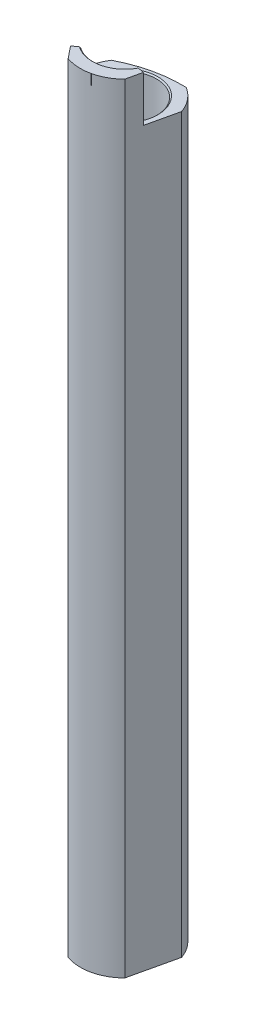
ISO-10303-21;
HEADER;
FILE_DESCRIPTION(('STEP AP214'),'2;1');
FILE_NAME('part.step','',(''),(''),'','','');
FILE_SCHEMA(('AUTOMOTIVE_DESIGN { 1 0 10303 214 1 1 1 1 }'));
ENDSEC;
DATA;
#1=APPLICATION_CONTEXT('core data for automotive mechanical design processes');
#2=APPLICATION_PROTOCOL_DEFINITION('international standard','automotive_design',2000,#1);
#3=PRODUCT_CONTEXT('',#1,'mechanical');
#4=PRODUCT('Part','Part','',(#3));
#5=PRODUCT_RELATED_PRODUCT_CATEGORY('part','',(#4));
#6=PRODUCT_DEFINITION_FORMATION('','',#4);
#7=PRODUCT_DEFINITION_CONTEXT('part definition',#1,'design');
#8=PRODUCT_DEFINITION('design','',#6,#7);
#9=PRODUCT_DEFINITION_SHAPE('','',#8);
#10=(LENGTH_UNIT() NAMED_UNIT(*) SI_UNIT(.MILLI.,.METRE.));
#11=(NAMED_UNIT(*) PLANE_ANGLE_UNIT() SI_UNIT($,.RADIAN.));
#12=(NAMED_UNIT(*) SI_UNIT($,.STERADIAN.) SOLID_ANGLE_UNIT());
#13=UNCERTAINTY_MEASURE_WITH_UNIT(LENGTH_MEASURE(1.E-05),#10,'distance_accuracy_value','');
#14=(GEOMETRIC_REPRESENTATION_CONTEXT(3) GLOBAL_UNCERTAINTY_ASSIGNED_CONTEXT((#13)) GLOBAL_UNIT_ASSIGNED_CONTEXT((#10,
#11,#12)) REPRESENTATION_CONTEXT('',''));
#15=CARTESIAN_POINT('',(0.,0.,0.));
#16=DIRECTION('',(0.,0.,1.));
#17=DIRECTION('',(1.,0.,0.));
#18=AXIS2_PLACEMENT_3D('',#15,#16,#17);
#19=CARTESIAN_POINT('',(0.,-364.49,0.));
#20=DIRECTION('',(0.,1.,0.));
#21=DIRECTION('',(0.,0.,1.));
#22=AXIS2_PLACEMENT_3D('',#19,#20,#21);
#23=CYLINDRICAL_SURFACE('',#22,60.96);
#24=DIRECTION('',(0.,1.,0.));
#25=VECTOR('',#24,1.);
#26=CARTESIAN_POINT('',(-28.2876545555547,-9.4805375,-53.9993536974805));
#27=LINE('',#26,#25);
#28=CARTESIAN_POINT('',(-28.2876545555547,-28.3718,-53.9993536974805));
#29=VERTEX_POINT('',#28);
#30=CARTESIAN_POINT('',(-28.2876545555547,-0.508000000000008,-53.9993536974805));
#31=VERTEX_POINT('',#30);
#32=EDGE_CURVE('E371',#29,#31,#27,.T.);
#33=ORIENTED_EDGE('',*,*,#32,.T.);
#34=CARTESIAN_POINT('',(0.,-0.508000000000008,0.));
#35=DIRECTION('',(0.,1.,0.));
#36=DIRECTION('',(0.,0.,1.));
#37=AXIS2_PLACEMENT_3D('',#34,#35,#36);
#38=CIRCLE('',#37,60.96);
#39=CARTESIAN_POINT('',(2.05685460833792,-0.508000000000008,-60.9252898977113));
#40=VERTEX_POINT('',#39);
#41=EDGE_CURVE('E321',#31,#40,#38,.F.);
#42=ORIENTED_EDGE('',*,*,#41,.T.);
#43=DIRECTION('',(0.,1.,0.));
#44=VECTOR('',#43,1.);
#45=CARTESIAN_POINT('',(2.05685460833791,-9.4805375,-60.9252898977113));
#46=LINE('',#45,#44);
#47=CARTESIAN_POINT('',(2.05685460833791,-28.3718,-60.9252898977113));
#48=VERTEX_POINT('',#47);
#49=EDGE_CURVE('E378',#40,#48,#46,.F.);
#50=ORIENTED_EDGE('',*,*,#49,.T.);
#51=CARTESIAN_POINT('',(0.,-28.3718,0.));
#52=DIRECTION('',(0.,-1.,0.));
#53=DIRECTION('',(0.,0.,-1.));
#54=AXIS2_PLACEMENT_3D('',#51,#52,#53);
#55=CIRCLE('',#54,60.96);
#56=EDGE_CURVE('E455',#48,#29,#55,.F.);
#57=ORIENTED_EDGE('',*,*,#56,.T.);
#58=EDGE_LOOP('',(#33,#42,#50,#57));
#59=FACE_BOUND('',#58,.T.);
#60=ADVANCED_FACE('F108',(#59),#23,.T.);
#61=CARTESIAN_POINT('',(-9.60845392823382,-256.300662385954,-42.0973872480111));
#62=DIRECTION('',(0.,1.,0.));
#63=DIRECTION('',(0.,0.,1.));
#64=AXIS2_PLACEMENT_3D('',#61,#62,#63);
#65=CYLINDRICAL_SURFACE('',#64,22.1488);
#66=CARTESIAN_POINT('',(-9.60845392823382,-29.0068,-42.0973872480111));
#67=DIRECTION('',(0.,-1.,0.));
#68=DIRECTION('',(0.,0.,-1.));
#69=AXIS2_PLACEMENT_3D('',#66,#67,#68);
#70=CIRCLE('',#69,22.1488);
#71=CARTESIAN_POINT('',(-27.5436367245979,-29.0068,-55.0934851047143));
#72=VERTEX_POINT('',#71);
#73=CARTESIAN_POINT('',(-26.0935079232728,-29.0068,-56.8896939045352));
#74=VERTEX_POINT('',#73);
#75=EDGE_CURVE('E374',#72,#74,#70,.T.);
#76=ORIENTED_EDGE('',*,*,#75,.T.);
#77=DIRECTION('',(0.,1.,0.));
#78=VECTOR('',#77,1.);
#79=CARTESIAN_POINT('',(-26.0935079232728,-256.300662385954,-56.8896939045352));
#80=LINE('',#79,#78);
#81=CARTESIAN_POINT('',(-26.0935079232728,-41.2623,-56.8896939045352));
#82=VERTEX_POINT('',#81);
#83=EDGE_CURVE('E593',#74,#82,#80,.F.);
#84=ORIENTED_EDGE('',*,*,#83,.T.);
#85=CARTESIAN_POINT('',(-9.60845392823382,-41.2623,-42.0973872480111));
#86=DIRECTION('',(0.,1.,0.));
#87=DIRECTION('',(0.,0.,1.));
#88=AXIS2_PLACEMENT_3D('',#85,#86,#87);
#89=CIRCLE('',#88,22.1488);
#90=CARTESIAN_POINT('',(-1.17407481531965,-41.2623,-62.5773918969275));
#91=VERTEX_POINT('',#90);
#92=EDGE_CURVE('E122',#91,#82,#89,.T.);
#93=ORIENTED_EDGE('',*,*,#92,.F.);
#94=DIRECTION('',(0.,1.,0.));
#95=VECTOR('',#94,1.);
#96=CARTESIAN_POINT('',(-1.17407481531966,-256.300662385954,-62.5773918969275));
#97=LINE('',#96,#95);
#98=CARTESIAN_POINT('',(-1.17407481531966,-29.0068,-62.5773918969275));
#99=VERTEX_POINT('',#98);
#100=EDGE_CURVE('E591',#91,#99,#97,.T.);
#101=ORIENTED_EDGE('',*,*,#100,.T.);
#102=CARTESIAN_POINT('',(-9.60845392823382,-29.0068,-42.0973872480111));
#103=DIRECTION('',(0.,-1.,0.));
#104=DIRECTION('',(0.,0.,-1.));
#105=AXIS2_PLACEMENT_3D('',#102,#103,#104);
#106=CIRCLE('',#105,22.1488);
#107=CARTESIAN_POINT('',(0.911791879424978,-29.0068,-61.5882509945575));
#108=VERTEX_POINT('',#107);
#109=EDGE_CURVE('E380',#99,#108,#106,.T.);
#110=ORIENTED_EDGE('',*,*,#109,.T.);
#111=CARTESIAN_POINT('',(0.911791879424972,-29.0068,-61.5882509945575));
#112=CARTESIAN_POINT('',(0.943001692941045,-29.0067975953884,-61.5714054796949));
#113=CARTESIAN_POINT('',(0.974168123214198,-29.006166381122,-61.554486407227));
#114=CARTESIAN_POINT('',(1.03638543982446,-29.0036022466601,-61.5205176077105));
#115=CARTESIAN_POINT('',(1.06743629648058,-29.0016690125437,-61.5034678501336));
#116=CARTESIAN_POINT('',(1.16075036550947,-28.9938168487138,-61.4519382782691));
#117=CARTESIAN_POINT('',(1.22277032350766,-28.9858442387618,-61.417296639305));
#118=CARTESIAN_POINT('',(1.34641821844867,-28.9636603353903,-61.3474580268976));
#119=CARTESIAN_POINT('',(1.40803174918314,-28.9493728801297,-61.3122594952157));
#120=CARTESIAN_POINT('',(1.52917235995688,-28.9134212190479,-61.242294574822));
#121=CARTESIAN_POINT('',(1.58870539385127,-28.891780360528,-61.207527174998));
#122=CARTESIAN_POINT('',(1.67641415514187,-28.8518221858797,-61.1557793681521));
#123=CARTESIAN_POINT('',(1.70586502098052,-28.8369360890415,-61.1383078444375));
#124=CARTESIAN_POINT('',(1.76346930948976,-28.8042044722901,-61.103960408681));
#125=CARTESIAN_POINT('',(1.79162283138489,-28.7863591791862,-61.0870844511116));
#126=CARTESIAN_POINT('',(1.84627235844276,-28.7469926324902,-61.0541700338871));
#127=CARTESIAN_POINT('',(1.8727516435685,-28.7254404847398,-61.0381402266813));
#128=CARTESIAN_POINT('',(1.92271275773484,-28.6780647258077,-61.0077648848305));
#129=CARTESIAN_POINT('',(1.94620204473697,-28.6522521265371,-60.9934151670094));
#130=CARTESIAN_POINT('',(1.97961700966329,-28.6074210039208,-60.9729313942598));
#131=CARTESIAN_POINT('',(1.99112874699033,-28.5900220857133,-60.9658575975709));
#132=CARTESIAN_POINT('',(2.01194508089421,-28.5534750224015,-60.9530446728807));
#133=CARTESIAN_POINT('',(2.02125125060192,-28.5343281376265,-60.9473045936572));
#134=CARTESIAN_POINT('',(2.03596134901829,-28.4970551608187,-60.9382205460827));
#135=CARTESIAN_POINT('',(2.04171611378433,-28.4791221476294,-60.9346615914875));
#136=CARTESIAN_POINT('',(2.05059051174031,-28.4423965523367,-60.9291703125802));
#137=CARTESIAN_POINT('',(2.0537166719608,-28.4236062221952,-60.9272339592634));
#138=CARTESIAN_POINT('',(2.05637258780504,-28.393737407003,-60.9255884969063));
#139=CARTESIAN_POINT('',(2.05686537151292,-28.3827685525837,-60.9252830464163));
#140=CARTESIAN_POINT('',(2.05685460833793,-28.3718,-60.9252898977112));
#141=B_SPLINE_CURVE_WITH_KNOTS('',3,(#111,#112,#113,#114,#115,#116,#117,#118,#119,#120,#121,
#122,#123,#124,#125,#126,#127,#128,#129,#130,#131,#132,#133,#134,#135,#136,#137,#138,#139,#140),
.UNSPECIFIED.,.F.,.F.,(4,2,2,2,2,2,2,2,2,2,2,2,2,2,4),(0.,0.106384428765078,0.212794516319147,
0.42699112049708,0.643844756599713,0.860016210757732,0.971925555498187,1.08382632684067,
1.19670941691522,1.30930518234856,1.37522321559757,1.44109409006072,1.49836523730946,
1.55549375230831,1.58839003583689),.UNSPECIFIED.);
#142=EDGE_CURVE('E487',#108,#48,#141,.T.);
#143=ORIENTED_EDGE('',*,*,#142,.T.);
#144=ORIENTED_EDGE('',*,*,#49,.F.);
#145=CARTESIAN_POINT('',(-9.60845392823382,-0.508000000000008,-42.0973872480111));
#146=DIRECTION('',(0.,1.,0.));
#147=DIRECTION('',(0.,0.,1.));
#148=AXIS2_PLACEMENT_3D('',#145,#146,#147);
#149=CIRCLE('',#148,22.1488);
#150=CARTESIAN_POINT('',(11.2857310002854,-0.507999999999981,-49.4460182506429));
#151=VERTEX_POINT('',#150);
#152=EDGE_CURVE('E314',#151,#40,#149,.T.);
#153=ORIENTED_EDGE('',*,*,#152,.F.);
#154=DIRECTION('',(0.,1.,0.));
#155=VECTOR('',#154,1.);
#156=CARTESIAN_POINT('',(11.2857310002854,-256.300662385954,-49.446018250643));
#157=LINE('',#156,#155);
#158=CARTESIAN_POINT('',(11.2857310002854,-364.49,-49.4460182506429));
#159=VERTEX_POINT('',#158);
#160=EDGE_CURVE('E365',#159,#151,#157,.T.);
#161=ORIENTED_EDGE('',*,*,#160,.F.);
#162=CARTESIAN_POINT('',(-9.60845392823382,-364.49,-42.0973872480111));
#163=DIRECTION('',(0.,1.,0.));
#164=DIRECTION('',(0.,0.,1.));
#165=AXIS2_PLACEMENT_3D('',#162,#163,#164);
#166=CIRCLE('',#165,22.1488);
#167=CARTESIAN_POINT('',(-11.1345751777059,-364.49,-64.1935474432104));
#168=VERTEX_POINT('',#167);
#169=EDGE_CURVE('E353',#168,#159,#166,.F.);
#170=ORIENTED_EDGE('',*,*,#169,.F.);
#171=DIRECTION('',(0.,1.,0.));
#172=VECTOR('',#171,1.);
#173=CARTESIAN_POINT('',(-11.1345751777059,-427.136266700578,-64.1935474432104));
#174=LINE('',#173,#172);
#175=CARTESIAN_POINT('',(-11.1345751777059,-47.8536,-64.1935474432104));
#176=VERTEX_POINT('',#175);
#177=EDGE_CURVE('E412',#176,#168,#174,.F.);
#178=ORIENTED_EDGE('',*,*,#177,.F.);
#179=CARTESIAN_POINT('',(-11.1345751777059,-47.8536,-64.1935474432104));
#180=CARTESIAN_POINT('',(-11.1345642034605,-47.7584804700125,-64.1935435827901));
#181=CARTESIAN_POINT('',(-11.1386015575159,-47.6633660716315,-64.1932692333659));
#182=CARTESIAN_POINT('',(-11.1546883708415,-47.47382916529,-64.1921517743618));
#183=CARTESIAN_POINT('',(-11.1667370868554,-47.3794065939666,-64.1913087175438));
#184=CARTESIAN_POINT('',(-11.1987420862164,-47.1920342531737,-64.1890274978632));
#185=CARTESIAN_POINT('',(-11.2186884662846,-47.0990827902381,-64.1875900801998));
#186=CARTESIAN_POINT('',(-11.2663032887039,-46.9152189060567,-64.1840674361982));
#187=CARTESIAN_POINT('',(-11.2939717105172,-46.8243064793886,-64.1819822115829));
#188=CARTESIAN_POINT('',(-11.3882787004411,-46.5555371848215,-64.1746516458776));
#189=CARTESIAN_POINT('',(-11.4662391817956,-46.3815311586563,-64.1683301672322));
#190=CARTESIAN_POINT('',(-11.6497808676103,-46.0490707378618,-64.1521090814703));
#191=CARTESIAN_POINT('',(-11.75536229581,-45.8906164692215,-64.1422094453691));
#192=CARTESIAN_POINT('',(-11.9918593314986,-45.5923109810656,-64.1178986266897));
#193=CARTESIAN_POINT('',(-12.1229584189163,-45.4526076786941,-64.1034542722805));
#194=CARTESIAN_POINT('',(-12.4060989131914,-45.1970652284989,-64.0692514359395));
#195=CARTESIAN_POINT('',(-12.5581443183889,-45.0812306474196,-64.0494919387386));
#196=CARTESIAN_POINT('',(-12.8795745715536,-44.8761387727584,-64.003906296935));
#197=CARTESIAN_POINT('',(-13.0490492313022,-44.7870294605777,-63.9780477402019));
#198=CARTESIAN_POINT('',(-13.3996158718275,-44.638897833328,-63.920033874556));
#199=CARTESIAN_POINT('',(-13.580700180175,-44.5798558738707,-63.8878826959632));
#200=CARTESIAN_POINT('',(-13.8877878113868,-44.5079276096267,-63.8292152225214));
#201=CARTESIAN_POINT('',(-14.012117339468,-44.4862253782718,-63.8043721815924));
#202=CARTESIAN_POINT('',(-14.2617832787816,-44.4572595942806,-63.7522316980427));
#203=CARTESIAN_POINT('',(-14.3871183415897,-44.4499791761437,-63.7249371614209));
#204=CARTESIAN_POINT('',(-14.5122591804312,-44.45,-63.6965084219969));
#205=B_SPLINE_CURVE_WITH_KNOTS('',3,(#179,#180,#181,#182,#183,#184,#185,#186,#187,#188,#189,
#190,#191,#192,#193,#194,#195,#196,#197,#198,#199,#200,#201,#202,#203,#204),.UNSPECIFIED.,.F.,
.F.,(4,2,2,2,2,2,2,2,2,2,2,2,4),(0.,0.28526347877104,0.570500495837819,0.85538096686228,
1.14026068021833,1.70966796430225,2.27907986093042,2.85274826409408,3.42652632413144,
4.00342518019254,4.57994663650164,4.96505549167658,5.34971371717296),.UNSPECIFIED.);
#206=CARTESIAN_POINT('',(-14.5122591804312,-44.45,-63.6965084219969));
#207=VERTEX_POINT('',#206);
#208=EDGE_CURVE('E450',#176,#207,#205,.T.);
#209=ORIENTED_EDGE('',*,*,#208,.T.);
#210=CARTESIAN_POINT('',(-9.60845392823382,-44.45,-42.0973872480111));
#211=DIRECTION('',(0.,1.,0.));
#212=DIRECTION('',(0.,0.,1.));
#213=AXIS2_PLACEMENT_3D('',#210,#211,#212);
#214=CIRCLE('',#213,22.1488);
#215=CARTESIAN_POINT('',(-14.56178551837,-44.45,-63.6852043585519));
#216=VERTEX_POINT('',#215);
#217=EDGE_CURVE('E409',#216,#207,#214,.F.);
#218=ORIENTED_EDGE('',*,*,#217,.F.);
#219=CARTESIAN_POINT('',(-14.56178551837,-44.45,-63.6852043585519));
#220=CARTESIAN_POINT('',(-14.6545245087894,-44.4499901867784,-63.6639314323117));
#221=CARTESIAN_POINT('',(-14.7471187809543,-44.4539896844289,-63.6420506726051));
#222=CARTESIAN_POINT('',(-14.9313634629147,-44.4699309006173,-63.5972685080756));
#223=CARTESIAN_POINT('',(-15.0230139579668,-44.4818718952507,-63.5743671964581));
#224=CARTESIAN_POINT('',(-15.2046215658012,-44.5136001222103,-63.5277638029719));
#225=CARTESIAN_POINT('',(-15.2945806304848,-44.5333776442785,-63.5040627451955));
#226=CARTESIAN_POINT('',(-15.4722716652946,-44.5806097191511,-63.4560733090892));
#227=CARTESIAN_POINT('',(-15.5600036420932,-44.6080642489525,-63.4317849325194));
#228=CARTESIAN_POINT('',(-15.8190082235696,-44.7016924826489,-63.3583941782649));
#229=CARTESIAN_POINT('',(-15.9862015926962,-44.7791505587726,-63.3087371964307));
#230=CARTESIAN_POINT('',(-16.3048272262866,-44.9618068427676,-63.2103178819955));
#231=CARTESIAN_POINT('',(-16.4562594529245,-45.0670051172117,-63.161555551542));
#232=CARTESIAN_POINT('',(-16.740661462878,-45.3030897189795,-63.066974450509));
#233=CARTESIAN_POINT('',(-16.8734895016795,-45.4341566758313,-63.0211795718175));
#234=CARTESIAN_POINT('',(-17.1159856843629,-45.7178889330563,-62.9354030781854));
#235=CARTESIAN_POINT('',(-17.225649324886,-45.8705584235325,-62.8954225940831));
#236=CARTESIAN_POINT('',(-17.4195100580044,-46.1941366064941,-62.8233982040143));
#237=CARTESIAN_POINT('',(-17.503567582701,-46.3651386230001,-62.7913979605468));
#238=CARTESIAN_POINT('',(-17.6431484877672,-46.7198646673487,-62.7376066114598));
#239=CARTESIAN_POINT('',(-17.6986906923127,-46.9035802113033,-62.7158087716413));
#240=CARTESIAN_POINT('',(-17.7662756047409,-47.2159135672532,-62.6891364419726));
#241=CARTESIAN_POINT('',(-17.7866427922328,-47.3425257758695,-62.6810442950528));
#242=CARTESIAN_POINT('',(-17.813820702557,-47.5972726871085,-62.670217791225));
#243=CARTESIAN_POINT('',(-17.8206471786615,-47.7254054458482,-62.667477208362));
#244=CARTESIAN_POINT('',(-17.8206307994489,-47.8536,-62.667498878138));
#245=B_SPLINE_CURVE_WITH_KNOTS('',3,(#219,#220,#221,#222,#223,#224,#225,#226,#227,#228,#229,
#230,#231,#232,#233,#234,#235,#236,#237,#238,#239,#240,#241,#242,#243,#244),.UNSPECIFIED.,.F.,
.F.,(4,2,2,2,2,2,2,2,2,2,2,2,4),(0.,0.285347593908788,0.570669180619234,0.855638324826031,
1.14060661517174,1.71019523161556,2.2797852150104,2.85350285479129,3.42733192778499,
4.00423492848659,4.58075659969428,4.96545855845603,5.34971269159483),.UNSPECIFIED.);
#246=CARTESIAN_POINT('',(-17.8206307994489,-47.8536,-62.667498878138));
#247=VERTEX_POINT('',#246);
#248=EDGE_CURVE('E424',#216,#247,#245,.T.);
#249=ORIENTED_EDGE('',*,*,#248,.T.);
#250=DIRECTION('',(0.,1.,0.));
#251=VECTOR('',#250,1.);
#252=CARTESIAN_POINT('',(-17.8206307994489,-427.136266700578,-62.667498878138));
#253=LINE('',#252,#251);
#254=CARTESIAN_POINT('',(-17.8206307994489,-364.49,-62.667498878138));
#255=VERTEX_POINT('',#254);
#256=EDGE_CURVE('E406',#255,#247,#253,.T.);
#257=ORIENTED_EDGE('',*,*,#256,.F.);
#258=CARTESIAN_POINT('',(-31.6219155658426,-364.49,-39.6526279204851));
#259=VERTEX_POINT('',#258);
#260=EDGE_CURVE('E356',#259,#255,#166,.F.);
#261=ORIENTED_EDGE('',*,*,#260,.F.);
#262=DIRECTION('',(0.,1.,0.));
#263=VECTOR('',#262,1.);
#264=CARTESIAN_POINT('',(-31.6219155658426,-256.300662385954,-39.6526279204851));
#265=LINE('',#264,#263);
#266=CARTESIAN_POINT('',(-31.6219155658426,-0.508000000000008,-39.6526279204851));
#267=VERTEX_POINT('',#266);
#268=EDGE_CURVE('E362',#259,#267,#265,.T.);
#269=ORIENTED_EDGE('',*,*,#268,.T.);
#270=EDGE_CURVE('E312',#31,#267,#149,.T.);
#271=ORIENTED_EDGE('',*,*,#270,.F.);
#272=ORIENTED_EDGE('',*,*,#32,.F.);
#273=CARTESIAN_POINT('',(-28.2876545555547,-28.3718,-53.9993536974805));
#274=CARTESIAN_POINT('',(-28.2876791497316,-28.3909447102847,-53.9993138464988));
#275=CARTESIAN_POINT('',(-28.2867210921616,-28.4100303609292,-54.0008187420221));
#276=CARTESIAN_POINT('',(-28.2830653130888,-28.447420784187,-54.0065538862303));
#277=CARTESIAN_POINT('',(-28.2803857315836,-28.4657316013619,-54.0107557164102));
#278=CARTESIAN_POINT('',(-28.2727232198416,-28.5053662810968,-54.0227572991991));
#279=CARTESIAN_POINT('',(-28.2673554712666,-28.5264303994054,-54.031157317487));
#280=CARTESIAN_POINT('',(-28.2548298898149,-28.5667177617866,-54.0507190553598));
#281=CARTESIAN_POINT('',(-28.2476645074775,-28.5859327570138,-54.0618924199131));
#282=CARTESIAN_POINT('',(-28.2278361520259,-28.6321290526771,-54.092737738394));
#283=CARTESIAN_POINT('',(-28.2142761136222,-28.6578056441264,-54.1137691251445));
#284=CARTESIAN_POINT('',(-28.1851638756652,-28.7051172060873,-54.1587268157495));
#285=CARTESIAN_POINT('',(-28.1696080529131,-28.726744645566,-54.1826583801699));
#286=CARTESIAN_POINT('',(-28.1385429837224,-28.7648871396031,-54.2302302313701));
#287=CARTESIAN_POINT('',(-28.1231424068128,-28.7816806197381,-54.2537220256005));
#288=CARTESIAN_POINT('',(-28.0915144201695,-28.8128260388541,-54.3017572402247));
#289=CARTESIAN_POINT('',(-28.0752863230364,-28.8271759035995,-54.3263015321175));
#290=CARTESIAN_POINT('',(-28.0255116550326,-28.8671932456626,-54.4012451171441));
#291=CARTESIAN_POINT('',(-27.9910215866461,-28.8896602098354,-54.452729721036));
#292=CARTESIAN_POINT('',(-27.9228240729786,-28.9266416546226,-54.5535770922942));
#293=CARTESIAN_POINT('',(-27.8892133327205,-28.9415806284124,-54.602857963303));
#294=CARTESIAN_POINT('',(-27.820967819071,-28.9665480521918,-54.7020413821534));
#295=CARTESIAN_POINT('',(-27.7863317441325,-28.9765699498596,-54.7519446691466));
#296=CARTESIAN_POINT('',(-27.7172492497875,-28.992066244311,-54.8505987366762));
#297=CARTESIAN_POINT('',(-27.6828214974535,-28.9976525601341,-54.8993455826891));
#298=CARTESIAN_POINT('',(-27.6135362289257,-29.005000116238,-54.9966090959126));
#299=CARTESIAN_POINT('',(-27.5786802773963,-29.0067725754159,-55.0451260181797));
#300=CARTESIAN_POINT('',(-27.5436367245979,-29.0068,-55.0934851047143));
#301=B_SPLINE_CURVE_WITH_KNOTS('',3,(#273,#274,#275,#276,#277,#278,#279,#280,#281,#282,#283,
#284,#285,#286,#287,#288,#289,#290,#291,#292,#293,#294,#295,#296,#297,#298,#299,#300),
.UNSPECIFIED.,.F.,.F.,(4,2,2,2,2,2,2,2,2,2,2,2,2,4),(0.,0.0572555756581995,0.113917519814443,
0.183443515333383,0.253266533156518,0.360224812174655,0.467380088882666,0.56541736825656,
0.663537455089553,0.860719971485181,1.04498725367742,1.22949942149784,1.40919324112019,
1.58835774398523),.UNSPECIFIED.);
#302=EDGE_CURVE('E481',#29,#72,#301,.T.);
#303=ORIENTED_EDGE('',*,*,#302,.T.);
#304=EDGE_LOOP('',(#76,#84,#93,#101,#110,#143,#144,#153,#161,#170,#178,#209,#218,#249,#257,#261,
#269,#271,#272,#303));
#305=FACE_BOUND('',#304,.T.);
#306=ADVANCED_FACE('F498',(#305),#65,.T.);
#307=CARTESIAN_POINT('',(72.898,-29.0068,0.));
#308=DIRECTION('',(0.,-1.,0.));
#309=DIRECTION('',(0.,0.,-1.));
#310=AXIS2_PLACEMENT_3D('',#307,#308,#309);
#311=PLANE('',#310);
#312=DIRECTION('',(0.974927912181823,0.,-0.222520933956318));
#313=VECTOR('',#312,1.);
#314=CARTESIAN_POINT('',(55.5898842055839,-29.0068,-75.8318100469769));
#315=LINE('',#314,#313);
#316=CARTESIAN_POINT('',(-25.2652050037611,-29.0068,-57.3771635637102));
#317=VERTEX_POINT('',#316);
#318=CARTESIAN_POINT('',(-15.7041838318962,-29.0068,-59.5594042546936));
#319=VERTEX_POINT('',#318);
#320=EDGE_CURVE('E330',#317,#319,#315,.T.);
#321=ORIENTED_EDGE('',*,*,#320,.F.);
#322=CARTESIAN_POINT('',(-24.9119530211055,-29.0068,-55.8294655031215));
#323=DIRECTION('',(0.,-1.,0.));
#324=DIRECTION('',(0.,0.,-1.));
#325=AXIS2_PLACEMENT_3D('',#322,#323,#324);
#326=CIRCLE('',#325,1.5875);
#327=EDGE_CURVE('E589',#317,#74,#326,.F.);
#328=ORIENTED_EDGE('',*,*,#327,.T.);
#329=ORIENTED_EDGE('',*,*,#75,.F.);
#330=CARTESIAN_POINT('',(0.,-29.0068,0.));
#331=DIRECTION('',(0.,-1.,0.));
#332=DIRECTION('',(0.,0.,-1.));
#333=AXIS2_PLACEMENT_3D('',#330,#331,#332);
#334=CIRCLE('',#333,61.595);
#335=EDGE_CURVE('E610',#72,#319,#334,.T.);
#336=ORIENTED_EDGE('',*,*,#335,.T.);
#337=EDGE_LOOP('',(#321,#328,#329,#336));
#338=FACE_BOUND('',#337,.T.);
#339=ADVANCED_FACE('F502',(#338),#311,.F.);
#340=ORIENTED_EDGE('',*,*,#109,.F.);
#341=CARTESIAN_POINT('',(-1.77860313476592,-29.0068,-61.1095016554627));
#342=DIRECTION('',(0.,-1.,0.));
#343=DIRECTION('',(0.,0.,-1.));
#344=AXIS2_PLACEMENT_3D('',#341,#342,#343);
#345=CIRCLE('',#344,1.5875);
#346=CARTESIAN_POINT('',(-2.13185511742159,-29.0068,-62.6571997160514));
#347=VERTEX_POINT('',#346);
#348=EDGE_CURVE('E595',#99,#347,#345,.F.);
#349=ORIENTED_EDGE('',*,*,#348,.T.);
#350=CARTESIAN_POINT('',(-11.6928762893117,-29.0068,-60.4749590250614));
#351=VERTEX_POINT('',#350);
#352=EDGE_CURVE('E327',#351,#347,#315,.T.);
#353=ORIENTED_EDGE('',*,*,#352,.F.);
#354=EDGE_CURVE('E611',#351,#108,#334,.T.);
#355=ORIENTED_EDGE('',*,*,#354,.T.);
#356=EDGE_LOOP('',(#340,#349,#353,#355));
#357=FACE_BOUND('',#356,.T.);
#358=ADVANCED_FACE('F473',(#357),#311,.F.);
#359=CARTESIAN_POINT('',(0.,-28.3718,0.));
#360=DIRECTION('',(0.,-1.,0.));
#361=DIRECTION('',(0.,0.,-1.));
#362=AXIS2_PLACEMENT_3D('',#359,#360,#361);
#363=TOROIDAL_SURFACE('',#362,61.595,0.635);
#364=CARTESIAN_POINT('',(-22.4030353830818,-28.1944175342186,-58.030435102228));
#365=CARTESIAN_POINT('',(-22.4143680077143,-28.2001675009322,-58.0278485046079));
#366=CARTESIAN_POINT('',(-22.4256017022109,-28.2061522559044,-58.0252844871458));
#367=CARTESIAN_POINT('',(-22.44784462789,-28.2188230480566,-58.0202076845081));
#368=CARTESIAN_POINT('',(-22.4588500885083,-28.2255160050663,-58.0176957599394));
#369=CARTESIAN_POINT('',(-22.4809280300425,-28.2400941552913,-58.0126566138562));
#370=CARTESIAN_POINT('',(-22.4919730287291,-28.2480237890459,-58.0101356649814));
#371=CARTESIAN_POINT('',(-22.5131092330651,-28.2650701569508,-58.0053114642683));
#372=CARTESIAN_POINT('',(-22.5232049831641,-28.2741806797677,-58.0030071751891));
#373=CARTESIAN_POINT('',(-22.5378560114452,-28.2898821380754,-57.9996631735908));
#374=CARTESIAN_POINT('',(-22.5429596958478,-28.2959282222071,-57.9984982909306));
#375=CARTESIAN_POINT('',(-22.5523120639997,-28.3086368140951,-57.9963636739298));
#376=CARTESIAN_POINT('',(-22.5565663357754,-28.3152948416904,-57.9953926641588));
#377=CARTESIAN_POINT('',(-22.5629648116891,-28.3275547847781,-57.9939322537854));
#378=CARTESIAN_POINT('',(-22.5653706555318,-28.3330107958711,-57.9933831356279));
#379=CARTESIAN_POINT('',(-22.5692913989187,-28.3442545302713,-57.9924882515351));
#380=CARTESIAN_POINT('',(-22.5708070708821,-28.3500419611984,-57.9921423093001));
#381=CARTESIAN_POINT('',(-22.5727760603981,-28.3618616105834,-57.991692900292));
#382=CARTESIAN_POINT('',(-22.5732201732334,-28.367895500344,-57.9915915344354));
#383=CARTESIAN_POINT('',(-22.5729527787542,-28.3799373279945,-57.9916525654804));
#384=CARTESIAN_POINT('',(-22.572240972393,-28.3859452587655,-57.9918150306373));
#385=CARTESIAN_POINT('',(-22.5699151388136,-28.3970075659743,-57.9923458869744));
#386=CARTESIAN_POINT('',(-22.5684203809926,-28.4020895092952,-57.9926870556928));
#387=CARTESIAN_POINT('',(-22.5647525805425,-28.4119843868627,-57.9935242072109));
#388=CARTESIAN_POINT('',(-22.5625793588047,-28.4167972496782,-57.994020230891));
#389=CARTESIAN_POINT('',(-22.5558346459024,-28.4296826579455,-57.9955596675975));
#390=CARTESIAN_POINT('',(-22.5506981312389,-28.4374418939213,-57.9967320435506));
#391=CARTESIAN_POINT('',(-22.5393623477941,-28.4520976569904,-57.999319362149));
#392=CARTESIAN_POINT('',(-22.5331591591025,-28.4589908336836,-58.0007351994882));
#393=CARTESIAN_POINT('',(-22.5097194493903,-28.482472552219,-58.0060851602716));
#394=CARTESIAN_POINT('',(-22.4906175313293,-28.4970566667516,-58.0104450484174));
#395=CARTESIAN_POINT('',(-22.450711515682,-28.5235052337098,-58.0195533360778));
#396=CARTESIAN_POINT('',(-22.4298970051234,-28.5353510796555,-58.0243041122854));
#397=CARTESIAN_POINT('',(-22.368895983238,-28.5668294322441,-58.0382271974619));
#398=CARTESIAN_POINT('',(-22.3276317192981,-28.5842539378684,-58.0476454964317));
#399=CARTESIAN_POINT('',(-22.2438952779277,-28.6157899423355,-58.0667577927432));
#400=CARTESIAN_POINT('',(-22.2014200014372,-28.629891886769,-58.076452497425));
#401=CARTESIAN_POINT('',(-22.1157458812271,-28.655879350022,-58.0960070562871));
#402=CARTESIAN_POINT('',(-22.0725459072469,-28.6677609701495,-58.1058671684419));
#403=CARTESIAN_POINT('',(-21.9858275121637,-28.6898933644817,-58.1256600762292));
#404=CARTESIAN_POINT('',(-21.9423096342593,-28.700146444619,-58.1355927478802));
#405=CARTESIAN_POINT('',(-21.812254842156,-28.7288812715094,-58.165276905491));
#406=CARTESIAN_POINT('',(-21.7253450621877,-28.7455825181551,-58.1851134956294));
#407=CARTESIAN_POINT('',(-21.55099951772,-28.7758374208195,-58.2249067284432));
#408=CARTESIAN_POINT('',(-21.4635635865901,-28.7893900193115,-58.2448634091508));
#409=CARTESIAN_POINT('',(-21.2882583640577,-28.814185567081,-58.2848756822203));
#410=CARTESIAN_POINT('',(-21.2003886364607,-28.8254252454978,-58.3049313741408));
#411=CARTESIAN_POINT('',(-21.0244454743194,-28.8460963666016,-58.3450892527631));
#412=CARTESIAN_POINT('',(-20.9363720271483,-28.8555276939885,-58.365191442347));
#413=CARTESIAN_POINT('',(-20.6721198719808,-28.8816409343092,-58.4255052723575));
#414=CARTESIAN_POINT('',(-20.4957390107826,-28.8961645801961,-58.4657630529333));
#415=CARTESIAN_POINT('',(-20.142867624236,-28.9212157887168,-58.5463036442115));
#416=CARTESIAN_POINT('',(-19.96637730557,-28.9317466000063,-58.5865864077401));
#417=CARTESIAN_POINT('',(-19.614165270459,-28.9498183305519,-58.6669765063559));
#418=CARTESIAN_POINT('',(-19.4384442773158,-28.9573743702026,-58.7070836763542));
#419=CARTESIAN_POINT('',(-19.0869247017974,-28.9702805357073,-58.7873157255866));
#420=CARTESIAN_POINT('',(-18.9111261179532,-28.9756306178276,-58.8274406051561));
#421=CARTESIAN_POINT('',(-18.3836372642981,-28.9891823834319,-58.9478364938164));
#422=CARTESIAN_POINT('',(-18.0318876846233,-28.9948840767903,-59.0281210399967));
#423=CARTESIAN_POINT('',(-17.3281480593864,-29.0025654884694,-59.1887450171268));
#424=CARTESIAN_POINT('',(-16.976157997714,-29.0045429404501,-59.2690844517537));
#425=CARTESIAN_POINT('',(-16.2721922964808,-29.0066921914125,-59.4297600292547));
#426=CARTESIAN_POINT('',(-15.9202166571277,-29.0068640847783,-59.5100961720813));
#427=CARTESIAN_POINT('',(-15.2164036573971,-29.0067040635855,-59.6707368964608));
#428=CARTESIAN_POINT('',(-14.8645662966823,-29.0063723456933,-59.7510414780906));
#429=CARTESIAN_POINT('',(-14.1608877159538,-29.0059298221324,-59.91165152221));
#430=CARTESIAN_POINT('',(-13.8090464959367,-29.0058190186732,-59.9919569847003));
#431=CARTESIAN_POINT('',(-13.1054124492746,-29.0059734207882,-60.1525568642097));
#432=CARTESIAN_POINT('',(-12.7536196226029,-29.0062385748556,-60.2328512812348));
#433=CARTESIAN_POINT('',(-12.0500328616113,-29.0067314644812,-60.3934403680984));
#434=CARTESIAN_POINT('',(-11.698238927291,-29.0069591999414,-60.4737350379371));
#435=CARTESIAN_POINT('',(-11.1250177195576,-29.0064865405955,-60.6045690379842));
#436=CARTESIAN_POINT('',(-10.9035903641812,-29.0060988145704,-60.6551083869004));
#437=CARTESIAN_POINT('',(-10.4607411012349,-29.0045404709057,-60.7561858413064));
#438=CARTESIAN_POINT('',(-10.239319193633,-29.0033698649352,-60.8067239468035));
#439=CARTESIAN_POINT('',(-9.79653653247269,-28.9997815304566,-60.9077861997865));
#440=CARTESIAN_POINT('',(-9.5751757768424,-28.9973640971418,-60.9583103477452));
#441=CARTESIAN_POINT('',(-9.13246640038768,-28.9906876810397,-61.0593558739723));
#442=CARTESIAN_POINT('',(-8.91111778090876,-28.9864285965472,-61.1098772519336));
#443=CARTESIAN_POINT('',(-8.46843786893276,-28.9752910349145,-61.2109160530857));
#444=CARTESIAN_POINT('',(-8.24710658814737,-28.9684120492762,-61.2614334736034));
#445=CARTESIAN_POINT('',(-7.80460541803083,-28.9509842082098,-61.3624314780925));
#446=CARTESIAN_POINT('',(-7.58343550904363,-28.9404359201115,-61.4129120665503));
#447=CARTESIAN_POINT('',(-7.25179120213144,-28.9206428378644,-61.4886077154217));
#448=CARTESIAN_POINT('',(-7.14120508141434,-28.9133786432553,-61.5138482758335));
#449=CARTESIAN_POINT('',(-6.9201516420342,-28.8972161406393,-61.5643022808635));
#450=CARTESIAN_POINT('',(-6.80968431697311,-28.8883179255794,-61.589515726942));
#451=CARTESIAN_POINT('',(-6.58885817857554,-28.8685005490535,-61.6399178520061));
#452=CARTESIAN_POINT('',(-6.47849945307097,-28.8575803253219,-61.6651065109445));
#453=CARTESIAN_POINT('',(-6.25804679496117,-28.8330538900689,-61.71542339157));
#454=CARTESIAN_POINT('',(-6.14795291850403,-28.8194471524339,-61.7405516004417));
#455=CARTESIAN_POINT('',(-6.03806211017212,-28.8041650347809,-61.7656334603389));
#456=B_SPLINE_CURVE_WITH_KNOTS('',3,(#364,#365,#366,#367,#368,#369,#370,#371,#372,#373,#374,
#375,#376,#377,#378,#379,#380,#381,#382,#383,#384,#385,#386,#387,#388,#389,#390,#391,#392,#393,
#394,#395,#396,#397,#398,#399,#400,#401,#402,#403,#404,#405,#406,#407,#408,#409,#410,#411,#412,
#413,#414,#415,#416,#417,#418,#419,#420,#421,#422,#423,#424,#425,#426,#427,#428,#429,#430,#431,
#432,#433,#434,#435,#436,#437,#438,#439,#440,#441,#442,#443,#444,#445,#446,#447,#448,#449,#450,
#451,#452,#453,#454,#455),.UNSPECIFIED.,.F.,.F.,(4,2,2,2,2,2,2,2,2,2,2,2,2,2,2,2,2,2,2,2,2,2,2,
2,2,2,2,2,2,2,2,2,2,2,2,2,2,2,2,2,2,2,2,2,2,4),(0.,0.0389232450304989,0.0782698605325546,
0.119706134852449,0.160932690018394,0.184876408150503,0.208657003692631,0.226557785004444,
0.244443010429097,0.262481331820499,0.280524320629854,0.296389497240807,0.312258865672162,
0.340230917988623,0.368308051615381,0.441012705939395,0.514197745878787,0.651146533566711,
0.788484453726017,0.926061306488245,1.06344158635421,1.33542600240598,1.60750163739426,
1.87995942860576,2.15243458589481,2.69685670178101,3.24083490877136,3.78201129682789,
4.32319841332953,5.40567670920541,6.48881352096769,7.5718937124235,8.65455105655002,
9.73721922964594,10.8197390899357,11.9022617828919,12.5836273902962,13.2649828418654,
13.9461770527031,14.6274088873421,15.3087730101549,15.9900318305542,16.3310096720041,
16.6719681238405,17.0131062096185,17.3543111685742),.UNSPECIFIED.);
#457=EDGE_CURVE('E492',#319,#351,#456,.T.);
#458=ORIENTED_EDGE('',*,*,#457,.F.);
#459=ORIENTED_EDGE('',*,*,#335,.F.);
#460=ORIENTED_EDGE('',*,*,#302,.F.);
#461=ORIENTED_EDGE('',*,*,#56,.F.);
#462=ORIENTED_EDGE('',*,*,#142,.F.);
#463=ORIENTED_EDGE('',*,*,#354,.F.);
#464=EDGE_LOOP('',(#458,#459,#460,#461,#462,#463));
#465=FACE_BOUND('',#464,.T.);
#466=ADVANCED_FACE('F467',(#465),#363,.F.);
#467=CARTESIAN_POINT('',(0.,-364.49,0.));
#468=DIRECTION('',(0.,1.,0.));
#469=DIRECTION('',(0.,0.,1.));
#470=AXIS2_PLACEMENT_3D('',#467,#468,#469);
#471=PLANE('',#470);
#472=ORIENTED_EDGE('',*,*,#169,.T.);
#473=DIRECTION('',(0.222520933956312,0.,-0.974927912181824));
#474=VECTOR('',#473,1.);
#475=CARTESIAN_POINT('',(11.2857310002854,-364.49,-49.4460182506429));
#476=LINE('',#475,#474);
#477=CARTESIAN_POINT('',(6.02810471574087,-364.49,-26.4108524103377));
#478=VERTEX_POINT('',#477);
#479=EDGE_CURVE('E337',#478,#159,#476,.T.);
#480=ORIENTED_EDGE('',*,*,#479,.F.);
#481=CARTESIAN_POINT('',(-9.60845392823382,-364.49,-42.0973872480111));
#482=DIRECTION('',(0.,1.,0.));
#483=DIRECTION('',(0.,0.,1.));
#484=AXIS2_PLACEMENT_3D('',#481,#482,#483);
#485=CIRCLE('',#484,22.1488);
#486=CARTESIAN_POINT('',(-16.8903740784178,-364.49,-21.1798591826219));
#487=VERTEX_POINT('',#486);
#488=EDGE_CURVE('E334',#487,#478,#485,.T.);
#489=ORIENTED_EDGE('',*,*,#488,.F.);
#490=DIRECTION('',(0.623489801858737,0.,0.781831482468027));
#491=VECTOR('',#490,1.);
#492=CARTESIAN_POINT('',(-16.8903740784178,-364.49,-21.1798591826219));
#493=LINE('',#492,#491);
#494=EDGE_CURVE('E331',#259,#487,#493,.T.);
#495=ORIENTED_EDGE('',*,*,#494,.F.);
#496=ORIENTED_EDGE('',*,*,#260,.T.);
#497=DIRECTION('',(-0.222520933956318,0.,-0.974927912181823));
#498=VECTOR('',#497,1.);
#499=CARTESIAN_POINT('',(-21.2782795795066,-364.49,-77.8164479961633));
#500=LINE('',#499,#498);
#501=CARTESIAN_POINT('',(-16.3716615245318,-364.49,-56.3191496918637));
#502=VERTEX_POINT('',#501);
#503=EDGE_CURVE('E341',#502,#255,#500,.T.);
#504=ORIENTED_EDGE('',*,*,#503,.F.);
#505=CARTESIAN_POINT('',(-9.60845392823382,-364.49,-42.0973872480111));
#506=DIRECTION('',(0.,-1.,0.));
#507=DIRECTION('',(-0.974927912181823,0.,0.222520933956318));
#508=AXIS2_PLACEMENT_3D('',#505,#506,#507);
#509=CIRCLE('',#508,15.748);
#510=CARTESIAN_POINT('',(-9.6856059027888,-364.49,-57.8451982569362));
#511=VERTEX_POINT('',#510);
#512=EDGE_CURVE('E391',#511,#502,#509,.T.);
#513=ORIENTED_EDGE('',*,*,#512,.F.);
#514=DIRECTION('',(0.222520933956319,0.,0.974927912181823));
#515=VECTOR('',#514,1.);
#516=CARTESIAN_POINT('',(-14.5922239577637,-364.49,-79.3424965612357));
#517=LINE('',#516,#515);
#518=EDGE_CURVE('E340',#168,#511,#517,.T.);
#519=ORIENTED_EDGE('',*,*,#518,.F.);
#520=EDGE_LOOP('',(#472,#480,#489,#495,#496,#504,#513,#519));
#521=FACE_BOUND('',#520,.T.);
#522=ADVANCED_FACE('F472',(#521),#471,.F.);
#523=CARTESIAN_POINT('',(0.,22.3012,0.));
#524=DIRECTION('',(0.,1.,0.));
#525=DIRECTION('',(0.,0.,1.));
#526=AXIS2_PLACEMENT_3D('',#523,#524,#525);
#527=PLANE('',#526);
#528=DIRECTION('',(-0.532032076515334,0.,0.846724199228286));
#529=VECTOR('',#528,1.);
#530=CARTESIAN_POINT('',(-4.6968383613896,22.3012,-20.5781934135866));
#531=LINE('',#530,#529);
#532=CARTESIAN_POINT('',(-4.6968383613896,22.3012,-20.5781934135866));
#533=VERTEX_POINT('',#532);
#534=CARTESIAN_POINT('',(-4.754073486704,22.3012,-20.4871042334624));
#535=VERTEX_POINT('',#534);
#536=EDGE_CURVE('E307',#533,#535,#531,.T.);
#537=ORIENTED_EDGE('',*,*,#536,.F.);
#538=DIRECTION('',(-0.846724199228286,0.,-0.532032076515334));
#539=VECTOR('',#538,1.);
#540=CARTESIAN_POINT('',(-4.6968383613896,22.3012,-20.5781934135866));
#541=LINE('',#540,#539);
#542=CARTESIAN_POINT('',(-4.60574918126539,22.3012,-20.5209582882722));
#543=VERTEX_POINT('',#542);
#544=EDGE_CURVE('E298',#543,#533,#541,.T.);
#545=ORIENTED_EDGE('',*,*,#544,.F.);
#546=CARTESIAN_POINT('',(-9.60845392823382,22.3012,-42.0973872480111));
#547=DIRECTION('',(0.,1.,0.));
#548=DIRECTION('',(0.,0.,1.));
#549=AXIS2_PLACEMENT_3D('',#546,#547,#548);
#550=CIRCLE('',#549,22.1488);
#551=CARTESIAN_POINT('',(6.02810471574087,22.3012,-26.4108524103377));
#552=VERTEX_POINT('',#551);
#553=EDGE_CURVE('E398',#543,#552,#550,.T.);
#554=ORIENTED_EDGE('',*,*,#553,.T.);
#555=DIRECTION('',(0.222520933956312,0.,-0.974927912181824));
#556=VECTOR('',#555,1.);
#557=CARTESIAN_POINT('',(0.,22.3012,0.));
#558=LINE('',#557,#556);
#559=CARTESIAN_POINT('',(7.74328345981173,22.3012,-33.9255414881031));
#560=VERTEX_POINT('',#559);
#561=EDGE_CURVE('E361',#552,#560,#558,.T.);
#562=ORIENTED_EDGE('',*,*,#561,.T.);
#563=CARTESIAN_POINT('',(0.,22.3012,0.));
#564=DIRECTION('',(0.,1.,0.));
#565=DIRECTION('',(-0.433883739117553,0.,-0.900968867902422));
#566=AXIS2_PLACEMENT_3D('',#563,#564,#565);
#567=CIRCLE('',#566,34.798);
#568=CARTESIAN_POINT('',(4.61418073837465,22.3012,-34.4907254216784));
#569=VERTEX_POINT('',#568);
#570=EDGE_CURVE('E382',#560,#569,#567,.T.);
#571=ORIENTED_EDGE('',*,*,#570,.T.);
#572=CARTESIAN_POINT('',(-9.60845392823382,22.3012,-42.0973872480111));
#573=DIRECTION('',(0.,1.,0.));
#574=DIRECTION('',(0.,0.,1.));
#575=AXIS2_PLACEMENT_3D('',#572,#573,#574);
#576=CIRCLE('',#575,16.129);
#577=CARTESIAN_POINT('',(-19.1221981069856,22.3012,-29.0730518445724));
#578=VERTEX_POINT('',#577);
#579=EDGE_CURVE('E624',#569,#578,#576,.F.);
#580=ORIENTED_EDGE('',*,*,#579,.T.);
#581=CARTESIAN_POINT('',(0.,22.3012,0.));
#582=DIRECTION('',(0.,1.,0.));
#583=DIRECTION('',(-0.974927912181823,0.,-0.222520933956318));
#584=AXIS2_PLACEMENT_3D('',#581,#582,#583);
#585=CIRCLE('',#584,34.798);
#586=CARTESIAN_POINT('',(-21.6961981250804,22.3012,-27.2061719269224));
#587=VERTEX_POINT('',#586);
#588=EDGE_CURVE('E389',#578,#587,#585,.T.);
#589=ORIENTED_EDGE('',*,*,#588,.T.);
#590=DIRECTION('',(0.623489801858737,0.,0.781831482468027));
#591=VECTOR('',#590,1.);
#592=CARTESIAN_POINT('',(0.,22.3012,0.));
#593=LINE('',#592,#591);
#594=CARTESIAN_POINT('',(-16.8903740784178,22.3012,-21.1798591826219));
#595=VERTEX_POINT('',#594);
#596=EDGE_CURVE('E375',#587,#595,#593,.T.);
#597=ORIENTED_EDGE('',*,*,#596,.T.);
#598=EDGE_CURVE('E403',#595,#535,#550,.T.);
#599=ORIENTED_EDGE('',*,*,#598,.T.);
#600=EDGE_LOOP('',(#537,#545,#554,#562,#571,#580,#589,#597,#599));
#601=FACE_BOUND('',#600,.T.);
#602=ADVANCED_FACE('F564',(#601),#527,.T.);
#603=CARTESIAN_POINT('',(0.,22.3012,0.));
#604=DIRECTION('',(0.,-1.,0.));
#605=DIRECTION('',(0.,0.,-1.));
#606=AXIS2_PLACEMENT_3D('',#603,#604,#605);
#607=CYLINDRICAL_SURFACE('',#606,34.798);
#608=ORIENTED_EDGE('',*,*,#588,.F.);
#609=CARTESIAN_POINT('',(-19.1221981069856,22.3012,-29.0730518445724));
#610=CARTESIAN_POINT('',(-19.0654319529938,22.2375625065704,-29.1103895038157));
#611=CARTESIAN_POINT('',(-19.0085032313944,22.1739937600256,-29.1475945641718));
#612=CARTESIAN_POINT('',(-18.8943206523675,22.0469937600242,-29.2217394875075));
#613=CARTESIAN_POINT('',(-18.8370667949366,21.9835625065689,-29.2586793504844));
#614=CARTESIAN_POINT('',(-18.7796503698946,21.9202,-29.2954866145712));
#615=B_SPLINE_CURVE_WITH_KNOTS('',3,(#609,#610,#611,#612,#613,#614),.UNSPECIFIED.,.F.,.F.,(4,2,
4),(0.,0.279275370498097,0.558550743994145),.UNSPECIFIED.);
#616=CARTESIAN_POINT('',(-18.7796503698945,21.9202,-29.2954866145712));
#617=VERTEX_POINT('',#616);
#618=EDGE_CURVE('E628',#578,#617,#615,.T.);
#619=ORIENTED_EDGE('',*,*,#618,.T.);
#620=DIRECTION('',(0.,-1.,0.));
#621=VECTOR('',#620,1.);
#622=CARTESIAN_POINT('',(-18.7796503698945,22.3012,-29.2954866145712));
#623=LINE('',#622,#621);
#624=CARTESIAN_POINT('',(-18.7796503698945,-1.14300000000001,-29.2954866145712));
#625=VERTEX_POINT('',#624);
#626=EDGE_CURVE('E385',#617,#625,#623,.T.);
#627=ORIENTED_EDGE('',*,*,#626,.T.);
#628=CARTESIAN_POINT('',(-18.7796503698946,-1.14300000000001,-29.2954866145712));
#629=CARTESIAN_POINT('',(-18.8752081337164,-1.03753480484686,-29.2342260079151));
#630=CARTESIAN_POINT('',(-18.9703194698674,-0.93188553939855,-29.1725979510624));
#631=CARTESIAN_POINT('',(-19.159649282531,-0.720218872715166,-29.0486069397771));
#632=CARTESIAN_POINT('',(-19.2538677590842,-0.614201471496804,-28.9862439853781));
#633=CARTESIAN_POINT('',(-19.347639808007,-0.507999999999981,-28.9235135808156));
#634=B_SPLINE_CURVE_WITH_KNOTS('',3,(#628,#629,#630,#631,#632,#633),.UNSPECIFIED.,.F.,.F.,(4,2,
4),(0.,0.46481561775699,0.929631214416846),.UNSPECIFIED.);
#635=CARTESIAN_POINT('',(-19.347639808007,-0.507999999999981,-28.9235135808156));
#636=VERTEX_POINT('',#635);
#637=EDGE_CURVE('E537',#625,#636,#634,.T.);
#638=ORIENTED_EDGE('',*,*,#637,.T.);
#639=CARTESIAN_POINT('',(0.,-0.508000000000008,0.));
#640=DIRECTION('',(0.,-1.,0.));
#641=DIRECTION('',(0.,0.,1.));
#642=AXIS2_PLACEMENT_3D('',#639,#640,#641);
#643=CIRCLE('',#642,34.798);
#644=CARTESIAN_POINT('',(-21.6961981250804,-0.508000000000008,-27.2061719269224));
#645=VERTEX_POINT('',#644);
#646=EDGE_CURVE('E315',#645,#636,#643,.T.);
#647=ORIENTED_EDGE('',*,*,#646,.F.);
#648=DIRECTION('',(0.,-1.,0.));
#649=VECTOR('',#648,1.);
#650=CARTESIAN_POINT('',(-21.6961981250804,22.3012,-27.2061719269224));
#651=LINE('',#650,#649);
#652=EDGE_CURVE('E396',#587,#645,#651,.T.);
#653=ORIENTED_EDGE('',*,*,#652,.F.);
#654=EDGE_LOOP('',(#608,#619,#627,#638,#647,#653));
#655=FACE_BOUND('',#654,.T.);
#656=ADVANCED_FACE('F517',(#655),#607,.T.);
#657=CARTESIAN_POINT('',(0.,22.3012,0.));
#658=DIRECTION('',(0.,-1.,0.));
#659=DIRECTION('',(0.,0.,-1.));
#660=AXIS2_PLACEMENT_3D('',#657,#658,#659);
#661=CYLINDRICAL_SURFACE('',#660,34.798);
#662=DIRECTION('',(0.,-1.,0.));
#663=VECTOR('',#662,1.);
#664=CARTESIAN_POINT('',(4.20904506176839,22.3012,-34.542506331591));
#665=LINE('',#664,#663);
#666=CARTESIAN_POINT('',(4.20904506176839,21.9202000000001,-34.542506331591));
#667=VERTEX_POINT('',#666);
#668=CARTESIAN_POINT('',(4.20904506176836,-1.14300000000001,-34.542506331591));
#669=VERTEX_POINT('',#668);
#670=EDGE_CURVE('E387',#667,#669,#665,.T.);
#671=ORIENTED_EDGE('',*,*,#670,.F.);
#672=CARTESIAN_POINT('',(4.20904506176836,21.9202,-34.542506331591));
#673=CARTESIAN_POINT('',(4.27674554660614,21.9835625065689,-34.5342561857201));
#674=CARTESIAN_POINT('',(4.34435709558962,22.0469937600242,-34.5258160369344));
#675=CARTESIAN_POINT('',(4.47940232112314,22.1739937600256,-34.5085557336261));
#676=CARTESIAN_POINT('',(4.54683599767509,22.2375625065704,-34.4997355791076));
#677=CARTESIAN_POINT('',(4.61418073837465,22.3012,-34.4907254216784));
#678=B_SPLINE_CURVE_WITH_KNOTS('',3,(#672,#673,#674,#675,#676,#677),.UNSPECIFIED.,.F.,.F.,(4,2,
4),(0.,0.279275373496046,0.55855074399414),.UNSPECIFIED.);
#679=EDGE_CURVE('E523',#667,#569,#678,.T.);
#680=ORIENTED_EDGE('',*,*,#679,.T.);
#681=ORIENTED_EDGE('',*,*,#570,.F.);
#682=DIRECTION('',(0.,-1.,0.));
#683=VECTOR('',#682,1.);
#684=CARTESIAN_POINT('',(7.74328345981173,22.3012,-33.9255414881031));
#685=LINE('',#684,#683);
#686=CARTESIAN_POINT('',(7.74328345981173,-0.508000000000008,-33.9255414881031));
#687=VERTEX_POINT('',#686);
#688=EDGE_CURVE('E394',#687,#560,#685,.F.);
#689=ORIENTED_EDGE('',*,*,#688,.F.);
#690=CARTESIAN_POINT('',(0.,-0.508000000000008,0.));
#691=DIRECTION('',(0.,-1.,0.));
#692=DIRECTION('',(0.,0.,1.));
#693=AXIS2_PLACEMENT_3D('',#690,#691,#692);
#694=CIRCLE('',#693,34.798);
#695=CARTESIAN_POINT('',(4.88217891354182,-0.507999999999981,-34.4538115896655));
#696=VERTEX_POINT('',#695);
#697=EDGE_CURVE('E301',#696,#687,#694,.T.);
#698=ORIENTED_EDGE('',*,*,#697,.F.);
#699=CARTESIAN_POINT('',(4.88217891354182,-0.507999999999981,-34.4538115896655));
#700=CARTESIAN_POINT('',(4.77047551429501,-0.614201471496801,-34.4696435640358));
#701=CARTESIAN_POINT('',(4.65852932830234,-0.720218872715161,-34.484950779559));
#702=CARTESIAN_POINT('',(4.43415137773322,-0.931885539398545,-34.5145156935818));
#703=CARTESIAN_POINT('',(4.32171961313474,-1.03753480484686,-34.5287733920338));
#704=CARTESIAN_POINT('',(4.20904506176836,-1.14300000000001,-34.542506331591));
#705=B_SPLINE_CURVE_WITH_KNOTS('',3,(#699,#700,#701,#702,#703,#704),.UNSPECIFIED.,.F.,.F.,(4,2,
4),(0.,0.464815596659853,0.929631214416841),.UNSPECIFIED.);
#706=EDGE_CURVE('E530',#696,#669,#705,.T.);
#707=ORIENTED_EDGE('',*,*,#706,.T.);
#708=EDGE_LOOP('',(#671,#680,#681,#689,#698,#707));
#709=FACE_BOUND('',#708,.T.);
#710=ADVANCED_FACE('F513',(#709),#661,.T.);
#711=CARTESIAN_POINT('',(-9.60845392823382,0.,-42.0973872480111));
#712=DIRECTION('',(0.,-1.,0.));
#713=DIRECTION('',(0.,0.,-1.));
#714=AXIS2_PLACEMENT_3D('',#711,#712,#713);
#715=CYLINDRICAL_SURFACE('',#714,15.748);
#716=ORIENTED_EDGE('',*,*,#670,.T.);
#717=CARTESIAN_POINT('',(-9.60845392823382,-1.14300000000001,-42.0973872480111));
#718=DIRECTION('',(0.,1.,0.));
#719=DIRECTION('',(0.,0.,1.));
#720=AXIS2_PLACEMENT_3D('',#717,#718,#719);
#721=CIRCLE('',#720,15.748);
#722=EDGE_CURVE('E538',#669,#625,#721,.T.);
#723=ORIENTED_EDGE('',*,*,#722,.T.);
#724=ORIENTED_EDGE('',*,*,#626,.F.);
#725=CARTESIAN_POINT('',(-9.60845392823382,21.9202,-42.0973872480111));
#726=DIRECTION('',(0.,1.,0.));
#727=DIRECTION('',(0.,0.,1.));
#728=AXIS2_PLACEMENT_3D('',#725,#726,#727);
#729=CIRCLE('',#728,15.748);
#730=EDGE_CURVE('E634',#617,#667,#729,.T.);
#731=ORIENTED_EDGE('',*,*,#730,.T.);
#732=EDGE_LOOP('',(#716,#723,#724,#731));
#733=FACE_BOUND('',#732,.T.);
#734=DIRECTION('',(0.,-1.,0.));
#735=VECTOR('',#734,1.);
#736=CARTESIAN_POINT('',(-16.3716615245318,0.,-56.3191496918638));
#737=LINE('',#736,#735);
#738=CARTESIAN_POINT('',(-16.3716615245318,-47.8536,-56.3191496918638));
#739=VERTEX_POINT('',#738);
#740=EDGE_CURVE('E343',#502,#739,#737,.F.);
#741=ORIENTED_EDGE('',*,*,#740,.T.);
#742=CARTESIAN_POINT('',(-16.3716615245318,-47.8536,-56.3191496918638));
#743=CARTESIAN_POINT('',(-16.3716697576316,-47.7590835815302,-56.3191386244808));
#744=CARTESIAN_POINT('',(-16.3680187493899,-47.6645730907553,-56.3208818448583));
#745=CARTESIAN_POINT('',(-16.3534628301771,-47.4762511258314,-56.3277940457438));
#746=CARTESIAN_POINT('',(-16.3425589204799,-47.3824395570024,-56.3329625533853));
#747=CARTESIAN_POINT('',(-16.3135868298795,-47.1963372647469,-56.3466307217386));
#748=CARTESIAN_POINT('',(-16.2955310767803,-47.1040441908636,-56.3551246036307));
#749=CARTESIAN_POINT('',(-16.2523968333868,-46.9214924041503,-56.3752753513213));
#750=CARTESIAN_POINT('',(-16.2273182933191,-46.8312337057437,-56.3869322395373));
#751=CARTESIAN_POINT('',(-16.1417658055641,-46.5644440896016,-56.4263558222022));
#752=CARTESIAN_POINT('',(-16.0709504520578,-46.3917427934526,-56.4585874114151));
#753=CARTESIAN_POINT('',(-15.9036291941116,-46.0616334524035,-56.5327116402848));
#754=CARTESIAN_POINT('',(-15.807118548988,-45.9042282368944,-56.5746060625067));
#755=CARTESIAN_POINT('',(-15.5890678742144,-45.6064850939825,-56.6660492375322));
#756=CARTESIAN_POINT('',(-15.4671773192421,-45.4664354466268,-56.7157024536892));
#757=CARTESIAN_POINT('',(-15.2021402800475,-45.2099194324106,-56.8191525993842));
#758=CARTESIAN_POINT('',(-15.058989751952,-45.09345756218,-56.8729503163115));
#759=CARTESIAN_POINT('',(-14.7532306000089,-44.8862378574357,-56.982191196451));
#760=CARTESIAN_POINT('',(-14.5904281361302,-44.7957718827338,-57.0376458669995));
#761=CARTESIAN_POINT('',(-14.2508592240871,-44.6450290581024,-57.1466157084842));
#762=CARTESIAN_POINT('',(-14.0741029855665,-44.5847303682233,-57.2001322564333));
#763=CARTESIAN_POINT('',(-13.7699657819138,-44.5104508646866,-57.2861221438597));
#764=CARTESIAN_POINT('',(-13.6449797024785,-44.4878115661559,-57.3198294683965));
#765=CARTESIAN_POINT('',(-13.3926332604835,-44.45757980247,-57.3845269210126));
#766=CARTESIAN_POINT('',(-13.2652751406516,-44.4499737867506,-57.4155194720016));
#767=CARTESIAN_POINT('',(-13.1374722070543,-44.45,-57.4448800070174));
#768=B_SPLINE_CURVE_WITH_KNOTS('',3,(#742,#743,#744,#745,#746,#747,#748,#749,#750,#751,#752,
#753,#754,#755,#756,#757,#758,#759,#760,#761,#762,#763,#764,#765,#766,#767),.UNSPECIFIED.,.F.,
.F.,(4,2,2,2,2,2,2,2,2,2,2,2,4),(0.,0.283452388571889,0.566865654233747,0.84978857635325,
1.13271350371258,1.69809171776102,2.26357431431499,2.83745743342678,3.41144985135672,
3.99165505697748,4.57143960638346,4.96483141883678,5.35786847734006),.UNSPECIFIED.);
#769=CARTESIAN_POINT('',(-13.1374722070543,-44.45,-57.4448800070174));
#770=VERTEX_POINT('',#769);
#771=EDGE_CURVE('E431',#739,#770,#768,.T.);
#772=ORIENTED_EDGE('',*,*,#771,.T.);
#773=CARTESIAN_POINT('',(-9.60845392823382,-44.45,-42.0973872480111));
#774=DIRECTION('',(0.,1.,0.));
#775=DIRECTION('',(0.,0.,1.));
#776=AXIS2_PLACEMENT_3D('',#773,#774,#775);
#777=CIRCLE('',#776,15.748);
#778=CARTESIAN_POINT('',(-13.0879458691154,-44.45,-57.4561840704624));
#779=VERTEX_POINT('',#778);
#780=EDGE_CURVE('E350',#770,#779,#777,.F.);
#781=ORIENTED_EDGE('',*,*,#780,.T.);
#782=CARTESIAN_POINT('',(-13.0879458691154,-44.45,-57.4561840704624));
#783=CARTESIAN_POINT('',(-12.9957009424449,-44.4499895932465,-57.4770902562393));
#784=CARTESIAN_POINT('',(-12.9032698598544,-44.4539425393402,-57.4971483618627));
#785=CARTESIAN_POINT('',(-12.7187180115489,-44.4696937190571,-57.5354757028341));
#786=CARTESIAN_POINT('',(-12.6265972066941,-44.4814909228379,-57.5537451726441));
#787=CARTESIAN_POINT('',(-12.4434779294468,-44.5128228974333,-57.5883789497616));
#788=CARTESIAN_POINT('',(-12.3524778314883,-44.5323446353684,-57.60474640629));
#789=CARTESIAN_POINT('',(-12.1721331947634,-44.5789503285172,-57.6355801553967));
#790=CARTESIAN_POINT('',(-12.0827886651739,-44.606034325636,-57.6500464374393));
#791=CARTESIAN_POINT('',(-11.8181944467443,-44.6983551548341,-57.6905988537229));
#792=CARTESIAN_POINT('',(-11.6462354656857,-44.7746864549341,-57.7138663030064));
#793=CARTESIAN_POINT('',(-11.316439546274,-44.9545860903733,-57.7533760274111));
#794=CARTESIAN_POINT('',(-11.1586049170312,-45.0581588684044,-57.769617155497));
#795=CARTESIAN_POINT('',(-10.8593079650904,-45.2913422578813,-57.7963605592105));
#796=CARTESIAN_POINT('',(-10.7181065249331,-45.4212979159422,-57.8067790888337));
#797=CARTESIAN_POINT('',(-10.4588427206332,-45.702834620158,-57.8229481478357));
#798=CARTESIAN_POINT('',(-10.3407851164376,-45.8544201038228,-57.8286977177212));
#799=CARTESIAN_POINT('',(-10.1303255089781,-46.1769240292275,-57.8370950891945));
#800=CARTESIAN_POINT('',(-10.0382175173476,-46.34803538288,-57.8397083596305));
#801=CARTESIAN_POINT('',(-9.88456871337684,-46.7034302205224,-57.8431551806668));
#802=CARTESIAN_POINT('',(-9.8230050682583,-46.8877037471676,-57.8439900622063));
#803=CARTESIAN_POINT('',(-9.74724009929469,-47.2031078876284,-57.8448056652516));
#804=CARTESIAN_POINT('',(-9.72416291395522,-47.3321724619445,-57.8449752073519));
#805=CARTESIAN_POINT('',(-9.69333657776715,-47.592002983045,-57.8451605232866));
#806=CARTESIAN_POINT('',(-9.68557404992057,-47.7227673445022,-57.8451764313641));
#807=CARTESIAN_POINT('',(-9.6856059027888,-47.8536,-57.8451982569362));
#808=B_SPLINE_CURVE_WITH_KNOTS('',3,(#782,#783,#784,#785,#786,#787,#788,#789,#790,#791,#792,
#793,#794,#795,#796,#797,#798,#799,#800,#801,#802,#803,#804,#805,#806,#807),.UNSPECIFIED.,.F.,
.F.,(4,2,2,2,2,2,2,2,2,2,2,2,4),(0.,0.283656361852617,0.567275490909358,0.850418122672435,
1.13356232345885,1.69939635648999,2.2653227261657,2.83919205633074,3.41317928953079,
3.99342987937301,4.57324605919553,4.965727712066,5.3578663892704),.UNSPECIFIED.);
#809=CARTESIAN_POINT('',(-9.6856059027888,-47.8536,-57.8451982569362));
#810=VERTEX_POINT('',#809);
#811=EDGE_CURVE('E456',#779,#810,#808,.T.);
#812=ORIENTED_EDGE('',*,*,#811,.T.);
#813=DIRECTION('',(0.,-1.,0.));
#814=VECTOR('',#813,1.);
#815=CARTESIAN_POINT('',(-9.6856059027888,0.,-57.8451982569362));
#816=LINE('',#815,#814);
#817=EDGE_CURVE('E348',#810,#511,#816,.T.);
#818=ORIENTED_EDGE('',*,*,#817,.T.);
#819=ORIENTED_EDGE('',*,*,#512,.T.);
#820=EDGE_LOOP('',(#741,#772,#781,#812,#818,#819));
#821=FACE_BOUND('',#820,.T.);
#822=ADVANCED_FACE('F507',(#733,#821),#715,.F.);
#823=CARTESIAN_POINT('',(6.02810471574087,-256.300662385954,-26.4108524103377));
#824=DIRECTION('',(0.974927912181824,0.,0.222520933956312));
#825=DIRECTION('',(0.222520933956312,0.,-0.974927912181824));
#826=AXIS2_PLACEMENT_3D('',#823,#824,#825);
#827=PLANE('',#826);
#828=DIRECTION('',(-0.222520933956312,0.,0.974927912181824));
#829=VECTOR('',#828,1.);
#830=CARTESIAN_POINT('',(6.02810471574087,-0.507999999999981,-26.4108524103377));
#831=LINE('',#830,#829);
#832=EDGE_CURVE('E318',#151,#687,#831,.T.);
#833=ORIENTED_EDGE('',*,*,#832,.T.);
#834=ORIENTED_EDGE('',*,*,#688,.T.);
#835=ORIENTED_EDGE('',*,*,#561,.F.);
#836=DIRECTION('',(0.,1.,0.));
#837=VECTOR('',#836,1.);
#838=CARTESIAN_POINT('',(6.02810471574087,-256.300662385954,-26.4108524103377));
#839=LINE('',#838,#837);
#840=EDGE_CURVE('E368',#478,#552,#839,.T.);
#841=ORIENTED_EDGE('',*,*,#840,.F.);
#842=ORIENTED_EDGE('',*,*,#479,.T.);
#843=ORIENTED_EDGE('',*,*,#160,.T.);
#844=EDGE_LOOP('',(#833,#834,#835,#841,#842,#843));
#845=FACE_BOUND('',#844,.T.);
#846=ADVANCED_FACE('F503',(#845),#827,.T.);
#847=CARTESIAN_POINT('',(-16.8903740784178,-256.300662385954,-21.1798591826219));
#848=DIRECTION('',(-0.781831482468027,0.,0.623489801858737));
#849=DIRECTION('',(0.623489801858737,0.,0.781831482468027));
#850=AXIS2_PLACEMENT_3D('',#847,#848,#849);
#851=PLANE('',#850);
#852=ORIENTED_EDGE('',*,*,#652,.T.);
#853=DIRECTION('',(-0.623489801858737,0.,-0.781831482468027));
#854=VECTOR('',#853,1.);
#855=CARTESIAN_POINT('',(-16.8903740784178,-0.508000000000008,-21.1798591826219));
#856=LINE('',#855,#854);
#857=EDGE_CURVE('E622',#645,#267,#856,.T.);
#858=ORIENTED_EDGE('',*,*,#857,.T.);
#859=ORIENTED_EDGE('',*,*,#268,.F.);
#860=ORIENTED_EDGE('',*,*,#494,.T.);
#861=DIRECTION('',(0.,1.,0.));
#862=VECTOR('',#861,1.);
#863=CARTESIAN_POINT('',(-16.8903740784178,-256.300662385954,-21.1798591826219));
#864=LINE('',#863,#862);
#865=EDGE_CURVE('E358',#487,#595,#864,.T.);
#866=ORIENTED_EDGE('',*,*,#865,.T.);
#867=ORIENTED_EDGE('',*,*,#596,.F.);
#868=EDGE_LOOP('',(#852,#858,#859,#860,#866,#867));
#869=FACE_BOUND('',#868,.T.);
#870=ADVANCED_FACE('F446',(#869),#851,.T.);
#871=CARTESIAN_POINT('',(-9.60845392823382,-256.300662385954,-42.0973872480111));
#872=DIRECTION('',(0.,1.,0.));
#873=DIRECTION('',(0.,0.,1.));
#874=AXIS2_PLACEMENT_3D('',#871,#872,#873);
#875=CYLINDRICAL_SURFACE('',#874,22.1488);
#876=DIRECTION('',(0.,1.,0.));
#877=VECTOR('',#876,1.);
#878=CARTESIAN_POINT('',(-4.754073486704,-256.300662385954,-20.4871042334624));
#879=LINE('',#878,#877);
#880=CARTESIAN_POINT('',(-4.754073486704,17.2212,-20.4871042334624));
#881=VERTEX_POINT('',#880);
#882=EDGE_CURVE('E305',#535,#881,#879,.F.);
#883=ORIENTED_EDGE('',*,*,#882,.F.);
#884=ORIENTED_EDGE('',*,*,#598,.F.);
#885=ORIENTED_EDGE('',*,*,#865,.F.);
#886=ORIENTED_EDGE('',*,*,#488,.T.);
#887=ORIENTED_EDGE('',*,*,#840,.T.);
#888=ORIENTED_EDGE('',*,*,#553,.F.);
#889=DIRECTION('',(0.,1.,0.));
#890=VECTOR('',#889,1.);
#891=CARTESIAN_POINT('',(-4.60574918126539,-256.300662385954,-20.5209582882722));
#892=LINE('',#891,#890);
#893=CARTESIAN_POINT('',(-4.60574918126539,17.2212,-20.5209582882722));
#894=VERTEX_POINT('',#893);
#895=EDGE_CURVE('E581',#894,#543,#892,.T.);
#896=ORIENTED_EDGE('',*,*,#895,.F.);
#897=CARTESIAN_POINT('',(-9.60845392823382,17.2212,-42.0973872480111));
#898=DIRECTION('',(0.,1.,0.));
#899=DIRECTION('',(0.,0.,1.));
#900=AXIS2_PLACEMENT_3D('',#897,#898,#899);
#901=CIRCLE('',#900,22.1488);
#902=EDGE_CURVE('E290',#894,#881,#901,.F.);
#903=ORIENTED_EDGE('',*,*,#902,.T.);
#904=EDGE_LOOP('',(#883,#884,#885,#886,#887,#888,#896,#903));
#905=FACE_BOUND('',#904,.T.);
#906=ADVANCED_FACE('F509',(#905),#875,.T.);
#907=CARTESIAN_POINT('',(-9.60845392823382,-41.2623,-42.0973872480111));
#908=DIRECTION('',(0.,1.,0.));
#909=DIRECTION('',(0.,0.,1.));
#910=AXIS2_PLACEMENT_3D('',#907,#908,#909);
#911=PLANE('',#910);
#912=ORIENTED_EDGE('',*,*,#92,.T.);
#913=CARTESIAN_POINT('',(-24.9119530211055,-41.2623,-55.8294655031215));
#914=DIRECTION('',(0.,1.,0.));
#915=DIRECTION('',(0.,0.,1.));
#916=AXIS2_PLACEMENT_3D('',#913,#914,#915);
#917=CIRCLE('',#916,1.5875);
#918=CARTESIAN_POINT('',(-25.2652050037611,-41.2623,-57.3771635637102));
#919=VERTEX_POINT('',#918);
#920=EDGE_CURVE('E116',#82,#919,#917,.F.);
#921=ORIENTED_EDGE('',*,*,#920,.T.);
#922=DIRECTION('',(0.974927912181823,0.,-0.222520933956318));
#923=VECTOR('',#922,1.);
#924=CARTESIAN_POINT('',(-1.65031476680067,-41.2623,-62.7671081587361));
#925=LINE('',#924,#923);
#926=CARTESIAN_POINT('',(-2.13185511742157,-41.2623,-62.6571997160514));
#927=VERTEX_POINT('',#926);
#928=EDGE_CURVE('E324',#919,#927,#925,.T.);
#929=ORIENTED_EDGE('',*,*,#928,.T.);
#930=CARTESIAN_POINT('',(-1.77860313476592,-41.2623,-61.1095016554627));
#931=DIRECTION('',(0.,1.,0.));
#932=DIRECTION('',(0.,0.,1.));
#933=AXIS2_PLACEMENT_3D('',#930,#931,#932);
#934=CIRCLE('',#933,1.5875);
#935=EDGE_CURVE('E16',#927,#91,#934,.F.);
#936=ORIENTED_EDGE('',*,*,#935,.T.);
#937=EDGE_LOOP('',(#912,#921,#929,#936));
#938=FACE_BOUND('',#937,.T.);
#939=ADVANCED_FACE('F444',(#938),#911,.T.);
#940=CARTESIAN_POINT('',(0.,-44.45,0.));
#941=DIRECTION('',(0.,1.,0.));
#942=DIRECTION('',(0.,0.,1.));
#943=AXIS2_PLACEMENT_3D('',#940,#941,#942);
#944=PLANE('',#943);
#945=ORIENTED_EDGE('',*,*,#780,.F.);
#946=DIRECTION('',(-0.222520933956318,0.,-0.974927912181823));
#947=VECTOR('',#946,1.);
#948=CARTESIAN_POINT('',(-14.5023661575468,-44.45,-63.4248711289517));
#949=LINE('',#948,#947);
#950=EDGE_CURVE('E417',#770,#216,#949,.T.);
#951=ORIENTED_EDGE('',*,*,#950,.T.);
#952=ORIENTED_EDGE('',*,*,#217,.T.);
#953=DIRECTION('',(0.222520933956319,0.,0.974927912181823));
#954=VECTOR('',#953,1.);
#955=CARTESIAN_POINT('',(-13.0038705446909,-44.45,-57.0878260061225));
#956=LINE('',#955,#954);
#957=EDGE_CURVE('E414',#207,#779,#956,.T.);
#958=ORIENTED_EDGE('',*,*,#957,.T.);
#959=EDGE_LOOP('',(#945,#951,#952,#958));
#960=FACE_BOUND('',#959,.T.);
#961=ADVANCED_FACE('F677',(#960),#944,.F.);
#962=CARTESIAN_POINT('',(-14.5922239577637,43.141528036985,-79.3424965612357));
#963=DIRECTION('',(0.974927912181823,0.,-0.222520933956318));
#964=DIRECTION('',(-0.222520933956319,0.,-0.974927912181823));
#965=AXIS2_PLACEMENT_3D('',#962,#963,#964);
#966=PLANE('',#965);
#967=ORIENTED_EDGE('',*,*,#817,.F.);
#968=DIRECTION('',(0.222520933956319,0.,0.974927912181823));
#969=VECTOR('',#968,1.);
#970=CARTESIAN_POINT('',(-11.1345751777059,-47.8536,-64.1935474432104));
#971=LINE('',#970,#969);
#972=EDGE_CURVE('E422',#810,#176,#971,.F.);
#973=ORIENTED_EDGE('',*,*,#972,.T.);
#974=ORIENTED_EDGE('',*,*,#177,.T.);
#975=ORIENTED_EDGE('',*,*,#518,.T.);
#976=EDGE_LOOP('',(#967,#973,#974,#975));
#977=FACE_BOUND('',#976,.T.);
#978=ADVANCED_FACE('F670',(#977),#966,.F.);
#979=CARTESIAN_POINT('',(-21.2782795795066,43.141528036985,-77.8164479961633));
#980=DIRECTION('',(-0.974927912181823,0.,0.222520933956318));
#981=DIRECTION('',(0.222520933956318,0.,0.974927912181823));
#982=AXIS2_PLACEMENT_3D('',#979,#980,#981);
#983=PLANE('',#982);
#984=ORIENTED_EDGE('',*,*,#256,.T.);
#985=DIRECTION('',(-0.222520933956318,0.,-0.974927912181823));
#986=VECTOR('',#985,1.);
#987=CARTESIAN_POINT('',(-16.3716615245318,-47.8536,-56.3191496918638));
#988=LINE('',#987,#986);
#989=EDGE_CURVE('E420',#247,#739,#988,.F.);
#990=ORIENTED_EDGE('',*,*,#989,.T.);
#991=ORIENTED_EDGE('',*,*,#740,.F.);
#992=ORIENTED_EDGE('',*,*,#503,.T.);
#993=EDGE_LOOP('',(#984,#990,#991,#992));
#994=FACE_BOUND('',#993,.T.);
#995=ADVANCED_FACE('F683',(#994),#983,.F.);
#996=CARTESIAN_POINT('',(-0.0247631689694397,-47.8536,0.00565203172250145));
#997=DIRECTION('',(0.222520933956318,0.,0.974927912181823));
#998=DIRECTION('',(0.974927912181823,0.,-0.222520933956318));
#999=AXIS2_PLACEMENT_3D('',#996,#997,#998);
#1000=CYLINDRICAL_SURFACE('',#999,3.4036);
#1001=ORIENTED_EDGE('',*,*,#771,.F.);
#1002=ORIENTED_EDGE('',*,*,#989,.F.);
#1003=ORIENTED_EDGE('',*,*,#248,.F.);
#1004=ORIENTED_EDGE('',*,*,#950,.F.);
#1005=EDGE_LOOP('',(#1001,#1002,#1003,#1004));
#1006=FACE_BOUND('',#1005,.T.);
#1007=ADVANCED_FACE('F437',(#1006),#1000,.F.);
#1008=CARTESIAN_POINT('',(0.0247631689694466,-47.8536,-0.00565203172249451));
#1009=DIRECTION('',(-0.222520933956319,0.,-0.974927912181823));
#1010=DIRECTION('',(-0.974927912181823,0.,0.222520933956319));
#1011=AXIS2_PLACEMENT_3D('',#1008,#1009,#1010);
#1012=CYLINDRICAL_SURFACE('',#1011,3.4036);
#1013=ORIENTED_EDGE('',*,*,#208,.F.);
#1014=ORIENTED_EDGE('',*,*,#972,.F.);
#1015=ORIENTED_EDGE('',*,*,#811,.F.);
#1016=ORIENTED_EDGE('',*,*,#957,.F.);
#1017=EDGE_LOOP('',(#1013,#1014,#1015,#1016));
#1018=FACE_BOUND('',#1017,.T.);
#1019=ADVANCED_FACE('F461',(#1018),#1012,.F.);
#1020=CARTESIAN_POINT('',(-1.65031476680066,22.3012,-62.7671081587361));
#1021=DIRECTION('',(-0.222520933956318,0.,-0.974927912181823));
#1022=DIRECTION('',(-0.974927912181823,0.,0.222520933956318));
#1023=AXIS2_PLACEMENT_3D('',#1020,#1021,#1022);
#1024=PLANE('',#1023);
#1025=ORIENTED_EDGE('',*,*,#928,.F.);
#1026=DIRECTION('',(0.,1.,0.));
#1027=VECTOR('',#1026,1.);
#1028=CARTESIAN_POINT('',(-25.2652050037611,22.3012,-57.3771635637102));
#1029=LINE('',#1028,#1027);
#1030=EDGE_CURVE('E583',#919,#317,#1029,.T.);
#1031=ORIENTED_EDGE('',*,*,#1030,.T.);
#1032=ORIENTED_EDGE('',*,*,#320,.T.);
#1033=ORIENTED_EDGE('',*,*,#457,.T.);
#1034=ORIENTED_EDGE('',*,*,#352,.T.);
#1035=DIRECTION('',(0.,1.,0.));
#1036=VECTOR('',#1035,1.);
#1037=CARTESIAN_POINT('',(-2.13185511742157,22.3012,-62.6571997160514));
#1038=LINE('',#1037,#1036);
#1039=EDGE_CURVE('E580',#347,#927,#1038,.F.);
#1040=ORIENTED_EDGE('',*,*,#1039,.T.);
#1041=EDGE_LOOP('',(#1025,#1031,#1032,#1033,#1034,#1040));
#1042=FACE_BOUND('',#1041,.T.);
#1043=ADVANCED_FACE('F465',(#1042),#1024,.T.);
#1044=CARTESIAN_POINT('',(-4.80422696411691,-0.508000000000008,-21.0486936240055));
#1045=DIRECTION('',(0.,1.,0.));
#1046=DIRECTION('',(0.,0.,1.));
#1047=AXIS2_PLACEMENT_3D('',#1044,#1045,#1046);
#1048=PLANE('',#1047);
#1049=ORIENTED_EDGE('',*,*,#646,.T.);
#1050=CARTESIAN_POINT('',(-9.60845392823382,-0.508000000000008,-42.0973872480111));
#1051=DIRECTION('',(0.,1.,0.));
#1052=DIRECTION('',(0.,0.,1.));
#1053=AXIS2_PLACEMENT_3D('',#1050,#1051,#1052);
#1054=CIRCLE('',#1053,16.383);
#1055=EDGE_CURVE('E638',#636,#696,#1054,.F.);
#1056=ORIENTED_EDGE('',*,*,#1055,.T.);
#1057=ORIENTED_EDGE('',*,*,#697,.T.);
#1058=ORIENTED_EDGE('',*,*,#832,.F.);
#1059=ORIENTED_EDGE('',*,*,#152,.T.);
#1060=ORIENTED_EDGE('',*,*,#41,.F.);
#1061=ORIENTED_EDGE('',*,*,#270,.T.);
#1062=ORIENTED_EDGE('',*,*,#857,.F.);
#1063=EDGE_LOOP('',(#1049,#1056,#1057,#1058,#1059,#1060,#1061,#1062));
#1064=FACE_BOUND('',#1063,.T.);
#1065=ADVANCED_FACE('F652',(#1064),#1048,.T.);
#1066=CARTESIAN_POINT('',(-9.60845392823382,22.3012,-42.0973872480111));
#1067=DIRECTION('',(0.,1.,0.));
#1068=DIRECTION('',(0.,0.,1.));
#1069=AXIS2_PLACEMENT_3D('',#1066,#1067,#1068);
#1070=CONICAL_SURFACE('',#1069,16.129,0.785398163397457);
#1071=ORIENTED_EDGE('',*,*,#679,.F.);
#1072=ORIENTED_EDGE('',*,*,#730,.F.);
#1073=ORIENTED_EDGE('',*,*,#618,.F.);
#1074=ORIENTED_EDGE('',*,*,#579,.F.);
#1075=EDGE_LOOP('',(#1071,#1072,#1073,#1074));
#1076=FACE_BOUND('',#1075,.T.);
#1077=ADVANCED_FACE('F475',(#1076),#1070,.F.);
#1078=CARTESIAN_POINT('',(-9.60845392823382,-0.508000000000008,-42.0973872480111));
#1079=DIRECTION('',(0.,1.,0.));
#1080=DIRECTION('',(0.,0.,1.));
#1081=AXIS2_PLACEMENT_3D('',#1078,#1079,#1080);
#1082=CONICAL_SURFACE('',#1081,16.383,0.785398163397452);
#1083=ORIENTED_EDGE('',*,*,#637,.F.);
#1084=ORIENTED_EDGE('',*,*,#722,.F.);
#1085=ORIENTED_EDGE('',*,*,#706,.F.);
#1086=ORIENTED_EDGE('',*,*,#1055,.F.);
#1087=EDGE_LOOP('',(#1083,#1084,#1085,#1086));
#1088=FACE_BOUND('',#1087,.T.);
#1089=ADVANCED_FACE('F543',(#1088),#1082,.F.);
#1090=CARTESIAN_POINT('',(-4.6968383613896,17.2212,-20.5781934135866));
#1091=DIRECTION('',(-0.846724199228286,0.,-0.532032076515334));
#1092=DIRECTION('',(-0.532032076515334,0.,0.846724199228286));
#1093=AXIS2_PLACEMENT_3D('',#1090,#1091,#1092);
#1094=PLANE('',#1093);
#1095=ORIENTED_EDGE('',*,*,#882,.T.);
#1096=DIRECTION('',(-0.532032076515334,0.,0.846724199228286));
#1097=VECTOR('',#1096,1.);
#1098=CARTESIAN_POINT('',(-4.6968383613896,17.2212,-20.5781934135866));
#1099=LINE('',#1098,#1097);
#1100=CARTESIAN_POINT('',(-4.6968383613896,17.2212,-20.5781934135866));
#1101=VERTEX_POINT('',#1100);
#1102=EDGE_CURVE('E287',#1101,#881,#1099,.T.);
#1103=ORIENTED_EDGE('',*,*,#1102,.F.);
#1104=DIRECTION('',(0.,1.,0.));
#1105=VECTOR('',#1104,1.);
#1106=CARTESIAN_POINT('',(-4.6968383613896,17.2212,-20.5781934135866));
#1107=LINE('',#1106,#1105);
#1108=EDGE_CURVE('E293',#1101,#533,#1107,.T.);
#1109=ORIENTED_EDGE('',*,*,#1108,.T.);
#1110=ORIENTED_EDGE('',*,*,#536,.T.);
#1111=EDGE_LOOP('',(#1095,#1103,#1109,#1110));
#1112=FACE_BOUND('',#1111,.T.);
#1113=ADVANCED_FACE('F303',(#1112),#1094,.F.);
#1114=CARTESIAN_POINT('',(-4.6968383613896,17.2212,-20.5781934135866));
#1115=DIRECTION('',(0.532032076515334,0.,-0.846724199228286));
#1116=DIRECTION('',(-0.846724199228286,0.,-0.532032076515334));
#1117=AXIS2_PLACEMENT_3D('',#1114,#1115,#1116);
#1118=PLANE('',#1117);
#1119=ORIENTED_EDGE('',*,*,#895,.T.);
#1120=ORIENTED_EDGE('',*,*,#544,.T.);
#1121=ORIENTED_EDGE('',*,*,#1108,.F.);
#1122=DIRECTION('',(-0.846724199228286,0.,-0.532032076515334));
#1123=VECTOR('',#1122,1.);
#1124=CARTESIAN_POINT('',(-4.6968383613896,17.2212,-20.5781934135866));
#1125=LINE('',#1124,#1123);
#1126=EDGE_CURVE('E283',#894,#1101,#1125,.T.);
#1127=ORIENTED_EDGE('',*,*,#1126,.F.);
#1128=EDGE_LOOP('',(#1119,#1120,#1121,#1127));
#1129=FACE_BOUND('',#1128,.T.);
#1130=ADVANCED_FACE('F296',(#1129),#1118,.F.);
#1131=CARTESIAN_POINT('',(-4.6968383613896,17.2212,-20.5781934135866));
#1132=DIRECTION('',(0.,1.,0.));
#1133=DIRECTION('',(0.,0.,1.));
#1134=AXIS2_PLACEMENT_3D('',#1131,#1132,#1133);
#1135=PLANE('',#1134);
#1136=ORIENTED_EDGE('',*,*,#1126,.T.);
#1137=ORIENTED_EDGE('',*,*,#1102,.T.);
#1138=ORIENTED_EDGE('',*,*,#902,.F.);
#1139=EDGE_LOOP('',(#1136,#1137,#1138));
#1140=FACE_BOUND('',#1139,.T.);
#1141=ADVANCED_FACE('F285',(#1140),#1135,.T.);
#1142=CARTESIAN_POINT('',(-24.9119530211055,-256.300662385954,-55.8294655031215));
#1143=DIRECTION('',(0.,1.,0.));
#1144=DIRECTION('',(0.,0.,1.));
#1145=AXIS2_PLACEMENT_3D('',#1142,#1143,#1144);
#1146=CYLINDRICAL_SURFACE('',#1145,1.5875);
#1147=ORIENTED_EDGE('',*,*,#920,.F.);
#1148=ORIENTED_EDGE('',*,*,#83,.F.);
#1149=ORIENTED_EDGE('',*,*,#327,.F.);
#1150=ORIENTED_EDGE('',*,*,#1030,.F.);
#1151=EDGE_LOOP('',(#1147,#1148,#1149,#1150));
#1152=FACE_BOUND('',#1151,.T.);
#1153=ADVANCED_FACE('F547',(#1152),#1146,.T.);
#1154=CARTESIAN_POINT('',(-1.77860313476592,-256.300662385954,-61.1095016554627));
#1155=DIRECTION('',(0.,1.,0.));
#1156=DIRECTION('',(0.,0.,1.));
#1157=AXIS2_PLACEMENT_3D('',#1154,#1155,#1156);
#1158=CYLINDRICAL_SURFACE('',#1157,1.5875);
#1159=ORIENTED_EDGE('',*,*,#935,.F.);
#1160=ORIENTED_EDGE('',*,*,#1039,.F.);
#1161=ORIENTED_EDGE('',*,*,#348,.F.);
#1162=ORIENTED_EDGE('',*,*,#100,.F.);
#1163=EDGE_LOOP('',(#1159,#1160,#1161,#1162));
#1164=FACE_BOUND('',#1163,.T.);
#1165=ADVANCED_FACE('F110',(#1164),#1158,.T.);
#1166=CLOSED_SHELL('',(#60,#306,#339,#358,#466,#522,#602,#656,#710,#822,#846,#870,#906,#939,
#961,#978,#995,#1007,#1019,#1043,#1065,#1077,#1089,#1113,#1130,#1141,#1153,#1165));
#1167=MANIFOLD_SOLID_BREP('B2',#1166);
#1168=ADVANCED_BREP_SHAPE_REPRESENTATION('',(#18,#1167),#14);
#1169=SHAPE_DEFINITION_REPRESENTATION(#9,#1168);
ENDSEC;
END-ISO-10303-21;
